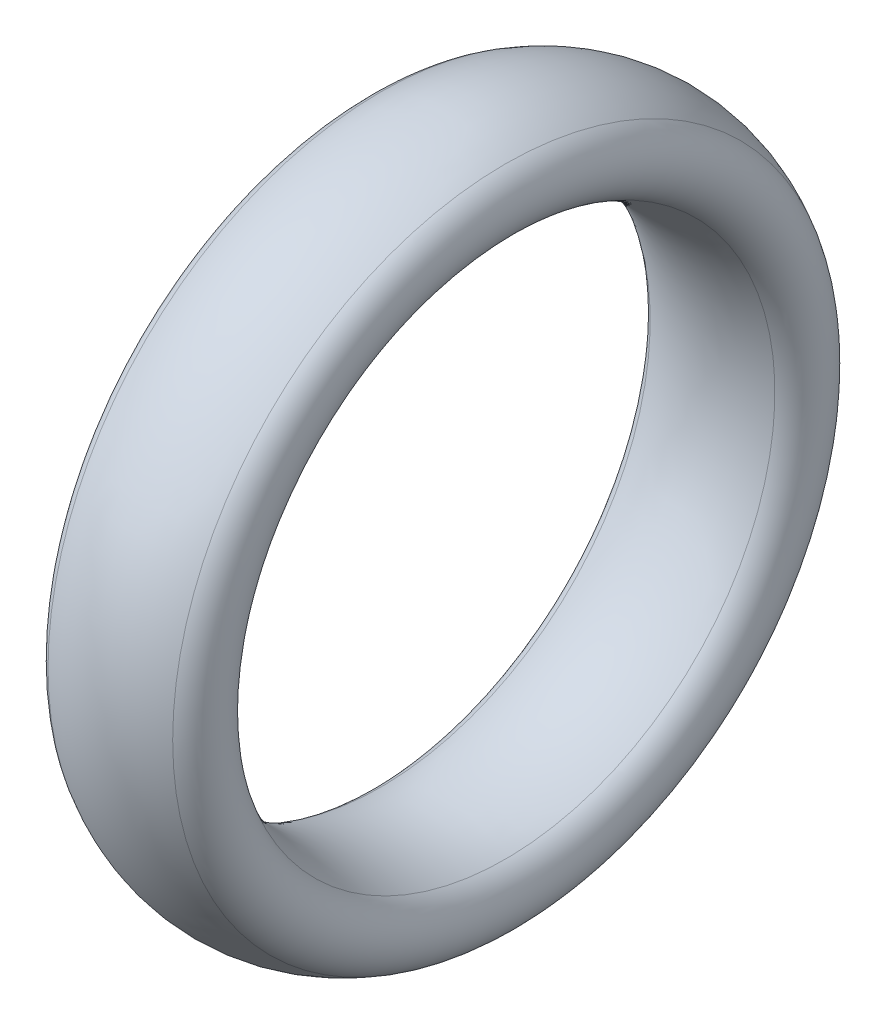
from build123d import *


with BuildPart() as part:
    # Esquisse1 → R_volution1 (revolve)
    with BuildSketch(Plane.XY, mode=Mode.PRIVATE) as r_volution1_sk:
        with BuildLine():
            ThreePointArc((19.697133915, 0.781859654), (19.242886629, 0), (19.697133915, -0.781859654))
            ThreePointArc((19.697133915, -0.781859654), (21.242886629, -1.19153918), (22.788639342, -0.781859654))
            ThreePointArc((22.788639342, -0.781859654), (23.242886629, 0), (22.788639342, 0.781859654))
            ThreePointArc((22.788639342, 0.781859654), (21.242886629, 1.19153918), (19.697133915, 0.781859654))
        make_face()
    revolve(r_volution1_sk.sketch.rotate(Axis((15.365996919, -7.46653918, 0), (1, 0, 0)), 90), axis=Axis((15.365996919, -7.46653918, 0), (1, 0, 0)))


solid = part.part
